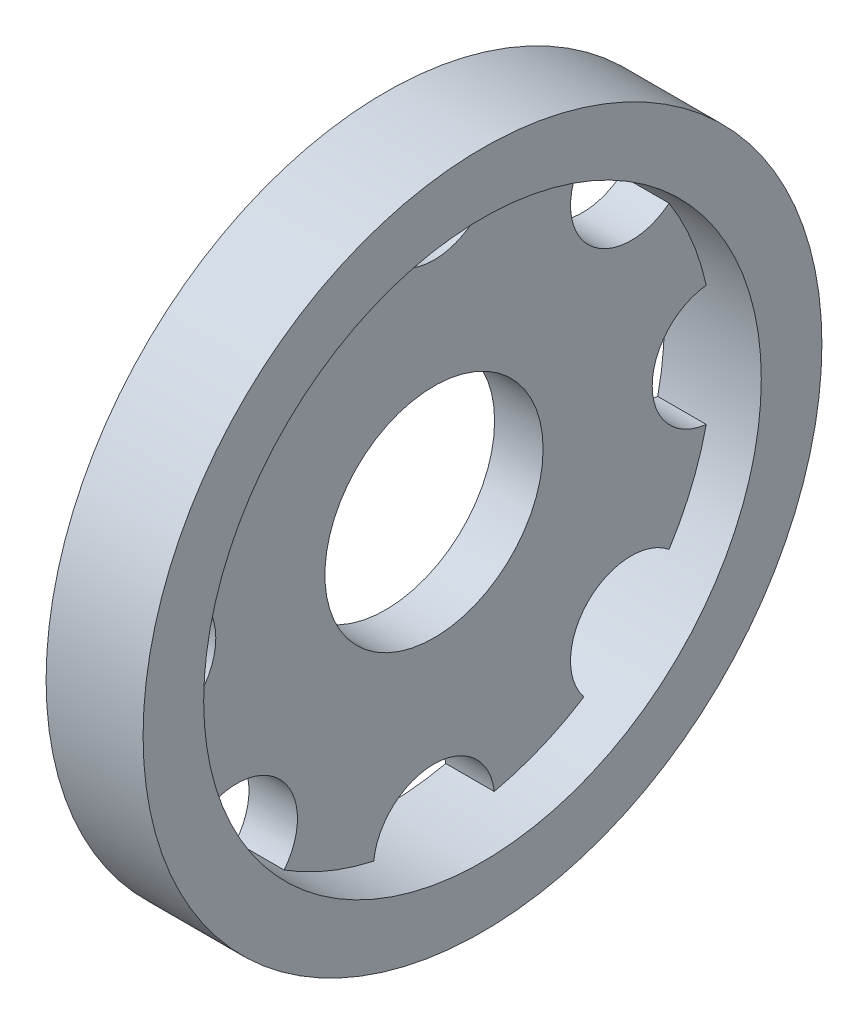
from build123d import *

# Parameters (mm, degrees)
ESBO_O1_R                = 4.5
RESSALTO_EXTRUS_O1_DEPTH = 2
ESBO_O2_R                = 14
ESBO_O2_R_2              = 11.5
RESSALTO_EXTRUS_O2_DEPTH = 2


with BuildPart() as part:
    # Esbo_o1 → Ressalto-extrus_o1 (new body)
    with BuildSketch(Plane(origin=(0, 0, 0), x_dir=(0, 0, -1), z_dir=(1, 0, 0))):
        with BuildLine():
            ThreePointArc((11.22826087, -2.485187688), (9, 0), (11.22826087, 2.485187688))
            ThreePointArc((11.22826087, 2.485187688), (10.624614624, 4.400859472), (9.696872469, 6.182286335))
            ThreePointArc((9.696872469, 6.182286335), (6.363961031, 6.363961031), (6.182286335, 9.696872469))
            ThreePointArc((6.182286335, 9.696872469), (4.400859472, 10.624614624), (2.485187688, 11.22826087))
            ThreePointArc((2.485187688, 11.22826087), (0, 9), (-2.485187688, 11.22826087))
            ThreePointArc((-2.485187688, 11.22826087), (-4.400859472, 10.624614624), (-6.182286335, 9.696872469))
            ThreePointArc((-6.182286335, 9.696872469), (-5.773380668, 8.961304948), (-5.631727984, 8.131727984))
            ThreePointArc((-5.631727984, 8.131727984), (-7.050724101, 5.877525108), (-9.696872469, 6.182286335))
            ThreePointArc((-9.696872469, 6.182286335), (-10.624614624, 4.400859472), (-11.22826087, 2.485187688))
            ThreePointArc((-11.22826087, 2.485187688), (-9.638636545, 1.668929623), (-9, 0))
            ThreePointArc((-9, 0), (-9.638636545, -1.668929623), (-11.22826087, -2.485187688))
            ThreePointArc((-11.22826087, -2.485187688), (-10.624614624, -4.400859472), (-9.696872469, -6.182286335))
            ThreePointArc((-9.696872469, -6.182286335), (-7.050724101, -5.877525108), (-5.631727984, -8.131727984))
            ThreePointArc((-5.631727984, -8.131727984), (-5.773380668, -8.961304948), (-6.182286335, -9.696872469))
            ThreePointArc((-6.182286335, -9.696872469), (-4.400859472, -10.624614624), (-2.485187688, -11.22826087))
            ThreePointArc((-2.485187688, -11.22826087), (0, -9), (2.485187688, -11.22826087))
            ThreePointArc((2.485187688, -11.22826087), (4.400859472, -10.624614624), (6.182286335, -9.696872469))
            ThreePointArc((6.182286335, -9.696872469), (6.363961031, -6.363961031), (9.696872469, -6.182286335))
            ThreePointArc((9.696872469, -6.182286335), (10.624614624, -4.400859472), (11.22826087, -2.485187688))
        make_face()
        Circle(ESBO_O1_R, mode=Mode.SUBTRACT)
    extrude(amount=RESSALTO_EXTRUS_O1_DEPTH)

    # Esbo_o2 → Ressalto-extrus_o2 (add, symmetric)
    with BuildSketch(Plane(origin=(2, 0, 0), x_dir=(0, 0, -1), z_dir=(1, 0, 0))):
        Circle(ESBO_O2_R)
        with Locations(Location((0, 0, 0), (0, 0, 167.519737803))):
            Circle(ESBO_O2_R_2, mode=Mode.SUBTRACT)
    extrude(amount=RESSALTO_EXTRUS_O2_DEPTH, both=True)


solid = part.part
